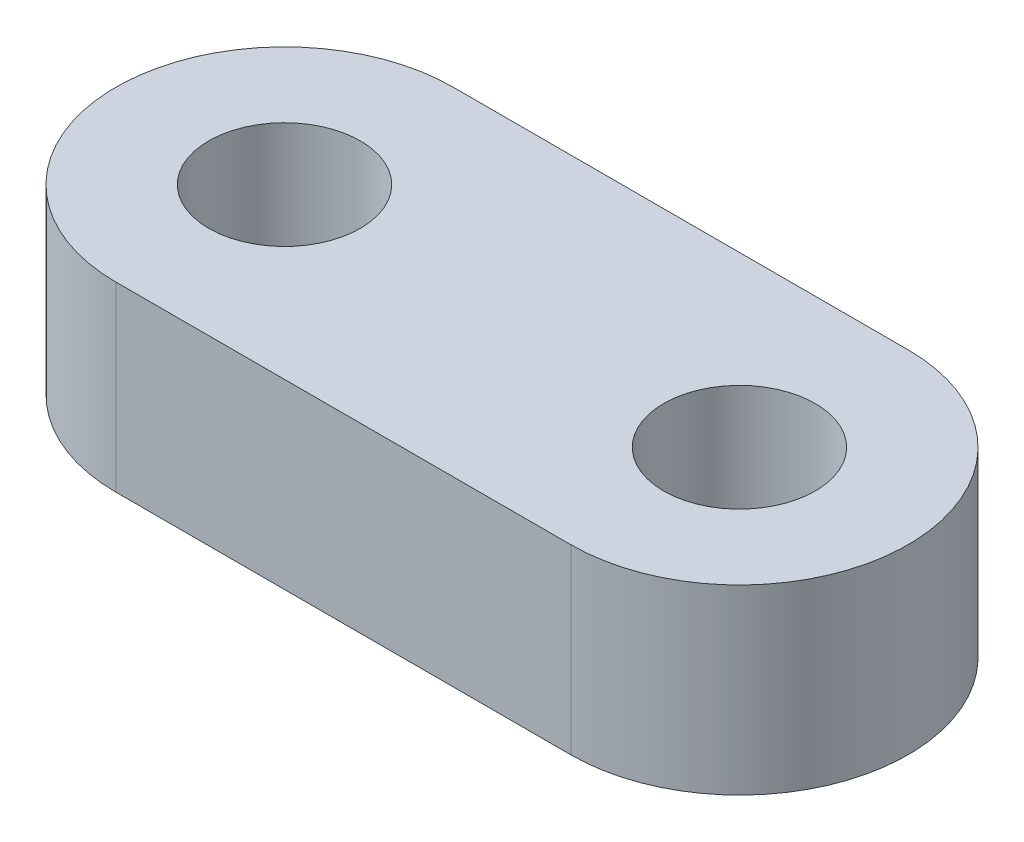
ISO-10303-21;
HEADER;
FILE_DESCRIPTION(('STEP AP214'),'2;1');
FILE_NAME('part.step','',(''),(''),'','','');
FILE_SCHEMA(('AUTOMOTIVE_DESIGN { 1 0 10303 214 1 1 1 1 }'));
ENDSEC;
DATA;
#1=APPLICATION_CONTEXT('core data for automotive mechanical design processes');
#2=APPLICATION_PROTOCOL_DEFINITION('international standard','automotive_design',2000,#1);
#3=PRODUCT_CONTEXT('',#1,'mechanical');
#4=PRODUCT('Part','Part','',(#3));
#5=PRODUCT_RELATED_PRODUCT_CATEGORY('part','',(#4));
#6=PRODUCT_DEFINITION_FORMATION('','',#4);
#7=PRODUCT_DEFINITION_CONTEXT('part definition',#1,'design');
#8=PRODUCT_DEFINITION('design','',#6,#7);
#9=PRODUCT_DEFINITION_SHAPE('','',#8);
#10=(LENGTH_UNIT() NAMED_UNIT(*) SI_UNIT(.MILLI.,.METRE.));
#11=(NAMED_UNIT(*) PLANE_ANGLE_UNIT() SI_UNIT($,.RADIAN.));
#12=(NAMED_UNIT(*) SI_UNIT($,.STERADIAN.) SOLID_ANGLE_UNIT());
#13=UNCERTAINTY_MEASURE_WITH_UNIT(LENGTH_MEASURE(1.E-05),#10,'distance_accuracy_value','');
#14=(GEOMETRIC_REPRESENTATION_CONTEXT(3) GLOBAL_UNCERTAINTY_ASSIGNED_CONTEXT((#13)) GLOBAL_UNIT_ASSIGNED_CONTEXT((#10,
#11,#12)) REPRESENTATION_CONTEXT('',''));
#15=CARTESIAN_POINT('',(0.,0.,0.));
#16=DIRECTION('',(0.,0.,1.));
#17=DIRECTION('',(1.,0.,0.));
#18=AXIS2_PLACEMENT_3D('',#15,#16,#17);
#19=CARTESIAN_POINT('',(0.,3.,0.));
#20=DIRECTION('',(0.,-1.,0.));
#21=DIRECTION('',(0.,0.,-1.));
#22=AXIS2_PLACEMENT_3D('',#19,#20,#21);
#23=PLANE('',#22);
#24=CARTESIAN_POINT('',(15.,3.,0.));
#25=DIRECTION('',(0.,1.,0.));
#26=DIRECTION('',(0.,0.,1.));
#27=AXIS2_PLACEMENT_3D('',#24,#25,#26);
#28=CIRCLE('',#27,2.5);
#29=CARTESIAN_POINT('',(15.,3.,2.5));
#30=VERTEX_POINT('',#29);
#31=EDGE_CURVE('E86',#30,#30,#28,.F.);
#32=ORIENTED_EDGE('',*,*,#31,.T.);
#33=EDGE_LOOP('',(#32));
#34=FACE_BOUND('',#33,.T.);
#35=CARTESIAN_POINT('',(0.,3.,0.));
#36=DIRECTION('',(0.,1.,0.));
#37=DIRECTION('',(0.,0.,1.));
#38=AXIS2_PLACEMENT_3D('',#35,#36,#37);
#39=CIRCLE('',#38,2.5);
#40=CARTESIAN_POINT('',(0.,3.,2.5));
#41=VERTEX_POINT('',#40);
#42=EDGE_CURVE('E89',#41,#41,#39,.F.);
#43=ORIENTED_EDGE('',*,*,#42,.T.);
#44=EDGE_LOOP('',(#43));
#45=FACE_BOUND('',#44,.T.);
#46=CARTESIAN_POINT('',(15.,3.,0.));
#47=DIRECTION('',(0.,-1.,0.));
#48=DIRECTION('',(0.,0.,-1.));
#49=AXIS2_PLACEMENT_3D('',#46,#47,#48);
#50=CIRCLE('',#49,5.5626);
#51=CARTESIAN_POINT('',(15.,3.,-5.5626));
#52=VERTEX_POINT('',#51);
#53=CARTESIAN_POINT('',(15.,3.,5.5626));
#54=VERTEX_POINT('',#53);
#55=EDGE_CURVE('E17',#52,#54,#50,.T.);
#56=ORIENTED_EDGE('',*,*,#55,.F.);
#57=DIRECTION('',(1.,0.,0.));
#58=VECTOR('',#57,1.);
#59=CARTESIAN_POINT('',(0.,3.,-5.5626));
#60=LINE('',#59,#58);
#61=CARTESIAN_POINT('',(0.,3.,-5.5626));
#62=VERTEX_POINT('',#61);
#63=EDGE_CURVE('E55',#62,#52,#60,.T.);
#64=ORIENTED_EDGE('',*,*,#63,.F.);
#65=CARTESIAN_POINT('',(0.,3.,0.));
#66=DIRECTION('',(0.,-1.,0.));
#67=DIRECTION('',(0.,0.,-1.));
#68=AXIS2_PLACEMENT_3D('',#65,#66,#67);
#69=CIRCLE('',#68,5.5626);
#70=CARTESIAN_POINT('',(0.,3.,5.5626));
#71=VERTEX_POINT('',#70);
#72=EDGE_CURVE('E72',#71,#62,#69,.T.);
#73=ORIENTED_EDGE('',*,*,#72,.F.);
#74=DIRECTION('',(1.,0.,0.));
#75=VECTOR('',#74,1.);
#76=CARTESIAN_POINT('',(15.,3.,5.5626));
#77=LINE('',#76,#75);
#78=EDGE_CURVE('E58',#54,#71,#77,.F.);
#79=ORIENTED_EDGE('',*,*,#78,.F.);
#80=EDGE_LOOP('',(#56,#64,#73,#79));
#81=FACE_BOUND('',#80,.T.);
#82=ADVANCED_FACE('F14',(#34,#45,#81),#23,.F.);
#83=CARTESIAN_POINT('',(15.,3.,0.));
#84=DIRECTION('',(0.,-1.,0.));
#85=DIRECTION('',(0.,0.,-1.));
#86=AXIS2_PLACEMENT_3D('',#83,#84,#85);
#87=CYLINDRICAL_SURFACE('',#86,5.5626);
#88=CARTESIAN_POINT('',(15.,-3.,0.));
#89=DIRECTION('',(0.,-1.,0.));
#90=DIRECTION('',(0.,0.,-1.));
#91=AXIS2_PLACEMENT_3D('',#88,#89,#90);
#92=CIRCLE('',#91,5.5626);
#93=CARTESIAN_POINT('',(15.,-3.,-5.5626));
#94=VERTEX_POINT('',#93);
#95=CARTESIAN_POINT('',(15.,-3.,5.5626));
#96=VERTEX_POINT('',#95);
#97=EDGE_CURVE('E65',#94,#96,#92,.T.);
#98=ORIENTED_EDGE('',*,*,#97,.F.);
#99=DIRECTION('',(0.,1.,0.));
#100=VECTOR('',#99,1.);
#101=CARTESIAN_POINT('',(15.,3.,-5.5626));
#102=LINE('',#101,#100);
#103=EDGE_CURVE('E62',#52,#94,#102,.F.);
#104=ORIENTED_EDGE('',*,*,#103,.F.);
#105=ORIENTED_EDGE('',*,*,#55,.T.);
#106=DIRECTION('',(0.,-1.,0.));
#107=VECTOR('',#106,1.);
#108=CARTESIAN_POINT('',(15.,3.,5.5626));
#109=LINE('',#108,#107);
#110=EDGE_CURVE('E77',#96,#54,#109,.F.);
#111=ORIENTED_EDGE('',*,*,#110,.F.);
#112=EDGE_LOOP('',(#98,#104,#105,#111));
#113=FACE_BOUND('',#112,.T.);
#114=ADVANCED_FACE('F63',(#113),#87,.T.);
#115=CARTESIAN_POINT('',(15.,3.,5.5626));
#116=DIRECTION('',(0.,0.,1.));
#117=DIRECTION('',(0.,-1.,0.));
#118=AXIS2_PLACEMENT_3D('',#115,#116,#117);
#119=PLANE('',#118);
#120=DIRECTION('',(1.,0.,0.));
#121=VECTOR('',#120,1.);
#122=CARTESIAN_POINT('',(0.,-3.,5.5626));
#123=LINE('',#122,#121);
#124=CARTESIAN_POINT('',(0.,-3.,5.5626));
#125=VERTEX_POINT('',#124);
#126=EDGE_CURVE('E84',#96,#125,#123,.F.);
#127=ORIENTED_EDGE('',*,*,#126,.F.);
#128=ORIENTED_EDGE('',*,*,#110,.T.);
#129=ORIENTED_EDGE('',*,*,#78,.T.);
#130=DIRECTION('',(0.,-1.,0.));
#131=VECTOR('',#130,1.);
#132=CARTESIAN_POINT('',(0.,3.,5.5626));
#133=LINE('',#132,#131);
#134=EDGE_CURVE('E74',#125,#71,#133,.F.);
#135=ORIENTED_EDGE('',*,*,#134,.F.);
#136=EDGE_LOOP('',(#127,#128,#129,#135));
#137=FACE_BOUND('',#136,.T.);
#138=ADVANCED_FACE('F100',(#137),#119,.T.);
#139=CARTESIAN_POINT('',(0.,3.,0.));
#140=DIRECTION('',(0.,-1.,0.));
#141=DIRECTION('',(0.,0.,-1.));
#142=AXIS2_PLACEMENT_3D('',#139,#140,#141);
#143=CYLINDRICAL_SURFACE('',#142,5.5626);
#144=DIRECTION('',(0.,1.,0.));
#145=VECTOR('',#144,1.);
#146=CARTESIAN_POINT('',(0.,3.,-5.5626));
#147=LINE('',#146,#145);
#148=CARTESIAN_POINT('',(0.,-3.,-5.5626));
#149=VERTEX_POINT('',#148);
#150=EDGE_CURVE('E68',#149,#62,#147,.T.);
#151=ORIENTED_EDGE('',*,*,#150,.F.);
#152=CARTESIAN_POINT('',(0.,-3.,0.));
#153=DIRECTION('',(0.,-1.,0.));
#154=DIRECTION('',(0.,0.,-1.));
#155=AXIS2_PLACEMENT_3D('',#152,#153,#154);
#156=CIRCLE('',#155,5.5626);
#157=EDGE_CURVE('E32',#125,#149,#156,.T.);
#158=ORIENTED_EDGE('',*,*,#157,.F.);
#159=ORIENTED_EDGE('',*,*,#134,.T.);
#160=ORIENTED_EDGE('',*,*,#72,.T.);
#161=EDGE_LOOP('',(#151,#158,#159,#160));
#162=FACE_BOUND('',#161,.T.);
#163=ADVANCED_FACE('F121',(#162),#143,.T.);
#164=CARTESIAN_POINT('',(0.,3.,-5.5626));
#165=DIRECTION('',(0.,0.,-1.));
#166=DIRECTION('',(0.,1.,0.));
#167=AXIS2_PLACEMENT_3D('',#164,#165,#166);
#168=PLANE('',#167);
#169=DIRECTION('',(1.,0.,0.));
#170=VECTOR('',#169,1.);
#171=CARTESIAN_POINT('',(0.,-3.,-5.5626));
#172=LINE('',#171,#170);
#173=EDGE_CURVE('E82',#149,#94,#172,.T.);
#174=ORIENTED_EDGE('',*,*,#173,.F.);
#175=ORIENTED_EDGE('',*,*,#150,.T.);
#176=ORIENTED_EDGE('',*,*,#63,.T.);
#177=ORIENTED_EDGE('',*,*,#103,.T.);
#178=EDGE_LOOP('',(#174,#175,#176,#177));
#179=FACE_BOUND('',#178,.T.);
#180=ADVANCED_FACE('F71',(#179),#168,.T.);
#181=CARTESIAN_POINT('',(0.,3.,0.));
#182=DIRECTION('',(0.,1.,0.));
#183=DIRECTION('',(0.,0.,1.));
#184=AXIS2_PLACEMENT_3D('',#181,#182,#183);
#185=CYLINDRICAL_SURFACE('',#184,2.5);
#186=ORIENTED_EDGE('',*,*,#42,.F.);
#187=EDGE_LOOP('',(#186));
#188=FACE_BOUND('',#187,.T.);
#189=CARTESIAN_POINT('',(0.,-3.,0.));
#190=DIRECTION('',(0.,1.,0.));
#191=DIRECTION('',(0.,0.,1.));
#192=AXIS2_PLACEMENT_3D('',#189,#190,#191);
#193=CIRCLE('',#192,2.5);
#194=CARTESIAN_POINT('',(0.,-3.,2.5));
#195=VERTEX_POINT('',#194);
#196=EDGE_CURVE('E23',#195,#195,#193,.T.);
#197=ORIENTED_EDGE('',*,*,#196,.F.);
#198=EDGE_LOOP('',(#197));
#199=FACE_BOUND('',#198,.T.);
#200=ADVANCED_FACE('F111',(#188,#199),#185,.F.);
#201=CARTESIAN_POINT('',(15.,3.,0.));
#202=DIRECTION('',(0.,1.,0.));
#203=DIRECTION('',(0.,0.,1.));
#204=AXIS2_PLACEMENT_3D('',#201,#202,#203);
#205=CYLINDRICAL_SURFACE('',#204,2.5);
#206=ORIENTED_EDGE('',*,*,#31,.F.);
#207=EDGE_LOOP('',(#206));
#208=FACE_BOUND('',#207,.T.);
#209=CARTESIAN_POINT('',(15.,-3.,0.));
#210=DIRECTION('',(0.,1.,0.));
#211=DIRECTION('',(0.,0.,1.));
#212=AXIS2_PLACEMENT_3D('',#209,#210,#211);
#213=CIRCLE('',#212,2.5);
#214=CARTESIAN_POINT('',(15.,-3.,2.5));
#215=VERTEX_POINT('',#214);
#216=EDGE_CURVE('E9',#215,#215,#213,.T.);
#217=ORIENTED_EDGE('',*,*,#216,.F.);
#218=EDGE_LOOP('',(#217));
#219=FACE_BOUND('',#218,.T.);
#220=ADVANCED_FACE('F103',(#208,#219),#205,.F.);
#221=CARTESIAN_POINT('',(0.,-3.,0.));
#222=DIRECTION('',(0.,-1.,0.));
#223=DIRECTION('',(0.,0.,-1.));
#224=AXIS2_PLACEMENT_3D('',#221,#222,#223);
#225=PLANE('',#224);
#226=ORIENTED_EDGE('',*,*,#216,.T.);
#227=EDGE_LOOP('',(#226));
#228=FACE_BOUND('',#227,.T.);
#229=ORIENTED_EDGE('',*,*,#196,.T.);
#230=EDGE_LOOP('',(#229));
#231=FACE_BOUND('',#230,.T.);
#232=ORIENTED_EDGE('',*,*,#157,.T.);
#233=ORIENTED_EDGE('',*,*,#173,.T.);
#234=ORIENTED_EDGE('',*,*,#97,.T.);
#235=ORIENTED_EDGE('',*,*,#126,.T.);
#236=EDGE_LOOP('',(#232,#233,#234,#235));
#237=FACE_BOUND('',#236,.T.);
#238=ADVANCED_FACE('F101',(#228,#231,#237),#225,.T.);
#239=CLOSED_SHELL('',(#82,#114,#138,#163,#180,#200,#220,#238));
#240=MANIFOLD_SOLID_BREP('B1',#239);
#241=ADVANCED_BREP_SHAPE_REPRESENTATION('',(#18,#240),#14);
#242=SHAPE_DEFINITION_REPRESENTATION(#9,#241);
ENDSEC;
END-ISO-10303-21;
